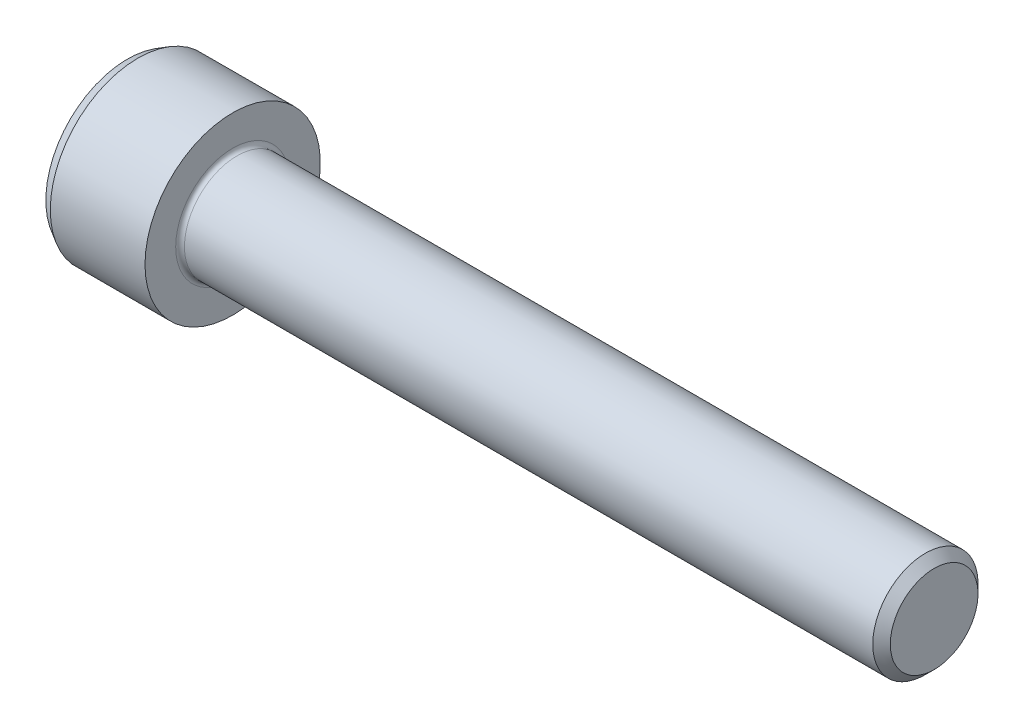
ISO-10303-21;
HEADER;
FILE_DESCRIPTION(('STEP AP214'),'2;1');
FILE_NAME('part.step','',(''),(''),'','','');
FILE_SCHEMA(('AUTOMOTIVE_DESIGN { 1 0 10303 214 1 1 1 1 }'));
ENDSEC;
DATA;
#1=APPLICATION_CONTEXT('core data for automotive mechanical design processes');
#2=APPLICATION_PROTOCOL_DEFINITION('international standard','automotive_design',2000,#1);
#3=PRODUCT_CONTEXT('',#1,'mechanical');
#4=PRODUCT('Part','Part','',(#3));
#5=PRODUCT_RELATED_PRODUCT_CATEGORY('part','',(#4));
#6=PRODUCT_DEFINITION_FORMATION('','',#4);
#7=PRODUCT_DEFINITION_CONTEXT('part definition',#1,'design');
#8=PRODUCT_DEFINITION('design','',#6,#7);
#9=PRODUCT_DEFINITION_SHAPE('','',#8);
#10=(LENGTH_UNIT() NAMED_UNIT(*) SI_UNIT(.MILLI.,.METRE.));
#11=(NAMED_UNIT(*) PLANE_ANGLE_UNIT() SI_UNIT($,.RADIAN.));
#12=(NAMED_UNIT(*) SI_UNIT($,.STERADIAN.) SOLID_ANGLE_UNIT());
#13=UNCERTAINTY_MEASURE_WITH_UNIT(LENGTH_MEASURE(1.E-05),#10,'distance_accuracy_value','');
#14=(GEOMETRIC_REPRESENTATION_CONTEXT(3) GLOBAL_UNCERTAINTY_ASSIGNED_CONTEXT((#13)) GLOBAL_UNIT_ASSIGNED_CONTEXT((#10,
#11,#12)) REPRESENTATION_CONTEXT('',''));
#15=CARTESIAN_POINT('',(0.,0.,0.));
#16=DIRECTION('',(0.,0.,1.));
#17=DIRECTION('',(1.,0.,0.));
#18=AXIS2_PLACEMENT_3D('',#15,#16,#17);
#19=CARTESIAN_POINT('',(-6.,5.,0.));
#20=DIRECTION('',(1.,0.,0.));
#21=DIRECTION('',(0.,0.,-1.));
#22=AXIS2_PLACEMENT_3D('',#19,#20,#21);
#23=PLANE('',#22);
#24=CARTESIAN_POINT('',(-6.,0.,0.));
#25=DIRECTION('',(1.,0.,0.));
#26=DIRECTION('',(0.,0.,-1.));
#27=AXIS2_PLACEMENT_3D('',#24,#25,#26);
#28=CIRCLE('',#27,4.65358983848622);
#29=CARTESIAN_POINT('',(-6.,0.,-4.65358983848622));
#30=VERTEX_POINT('',#29);
#31=EDGE_CURVE('E156',#30,#30,#28,.F.);
#32=ORIENTED_EDGE('',*,*,#31,.T.);
#33=EDGE_LOOP('',(#32));
#34=FACE_BOUND('',#33,.T.);
#35=CARTESIAN_POINT('',(-6.,0.,0.));
#36=DIRECTION('',(-1.,0.,0.));
#37=DIRECTION('',(0.,0.,1.));
#38=AXIS2_PLACEMENT_3D('',#35,#36,#37);
#39=CIRCLE('',#38,2.88675134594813);
#40=CARTESIAN_POINT('',(-6.,-1.44337567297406,-2.5));
#41=VERTEX_POINT('',#40);
#42=CARTESIAN_POINT('',(-6.,-2.88675134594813,0.));
#43=VERTEX_POINT('',#42);
#44=EDGE_CURVE('E286',#41,#43,#39,.T.);
#45=ORIENTED_EDGE('',*,*,#44,.F.);
#46=CARTESIAN_POINT('',(-6.,1.44337567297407,-2.5));
#47=VERTEX_POINT('',#46);
#48=EDGE_CURVE('E289',#47,#41,#39,.T.);
#49=ORIENTED_EDGE('',*,*,#48,.F.);
#50=CARTESIAN_POINT('',(-6.,2.88675134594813,0.));
#51=VERTEX_POINT('',#50);
#52=EDGE_CURVE('E296',#51,#47,#39,.T.);
#53=ORIENTED_EDGE('',*,*,#52,.F.);
#54=CARTESIAN_POINT('',(-6.,1.44337567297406,2.5));
#55=VERTEX_POINT('',#54);
#56=EDGE_CURVE('E60',#55,#51,#39,.T.);
#57=ORIENTED_EDGE('',*,*,#56,.F.);
#58=CARTESIAN_POINT('',(-6.,-1.44337567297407,2.5));
#59=VERTEX_POINT('',#58);
#60=EDGE_CURVE('E67',#59,#55,#39,.T.);
#61=ORIENTED_EDGE('',*,*,#60,.F.);
#62=EDGE_CURVE('E290',#43,#59,#39,.T.);
#63=ORIENTED_EDGE('',*,*,#62,.F.);
#64=EDGE_LOOP('',(#45,#49,#53,#57,#61,#63));
#65=FACE_BOUND('',#64,.T.);
#66=ADVANCED_FACE('F45',(#34,#65),#23,.F.);
#67=CARTESIAN_POINT('',(40.,0.,0.));
#68=DIRECTION('',(-1.,0.,0.));
#69=DIRECTION('',(0.,0.,1.));
#70=AXIS2_PLACEMENT_3D('',#67,#68,#69);
#71=PLANE('',#70);
#72=CARTESIAN_POINT('',(40.,0.,0.));
#73=DIRECTION('',(-1.,0.,0.));
#74=DIRECTION('',(0.,0.,1.));
#75=AXIS2_PLACEMENT_3D('',#72,#73,#74);
#76=CIRCLE('',#75,2.49999999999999);
#77=CARTESIAN_POINT('',(40.,0.,2.49999999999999));
#78=VERTEX_POINT('',#77);
#79=EDGE_CURVE('E11',#78,#78,#76,.F.);
#80=ORIENTED_EDGE('',*,*,#79,.T.);
#81=EDGE_LOOP('',(#80));
#82=FACE_BOUND('',#81,.T.);
#83=ADVANCED_FACE('F272',(#82),#71,.F.);
#84=CARTESIAN_POINT('',(-24.6844493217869,0.,0.));
#85=DIRECTION('',(-1.,0.,0.));
#86=DIRECTION('',(0.,0.,1.));
#87=AXIS2_PLACEMENT_3D('',#84,#85,#86);
#88=CYLINDRICAL_SURFACE('',#87,2.99999999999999);
#89=CARTESIAN_POINT('',(39.5,0.,0.));
#90=DIRECTION('',(-1.,0.,0.));
#91=DIRECTION('',(0.,0.,1.));
#92=AXIS2_PLACEMENT_3D('',#89,#90,#91);
#93=CIRCLE('',#92,2.99999999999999);
#94=CARTESIAN_POINT('',(39.5,0.,2.99999999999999));
#95=VERTEX_POINT('',#94);
#96=EDGE_CURVE('E54',#95,#95,#93,.T.);
#97=ORIENTED_EDGE('',*,*,#96,.T.);
#98=EDGE_LOOP('',(#97));
#99=FACE_BOUND('',#98,.T.);
#100=CARTESIAN_POINT('',(0.25,0.,0.));
#101=DIRECTION('',(-1.,0.,0.));
#102=DIRECTION('',(0.,0.,1.));
#103=AXIS2_PLACEMENT_3D('',#100,#101,#102);
#104=CIRCLE('',#103,2.99999999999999);
#105=CARTESIAN_POINT('',(0.25,0.,2.99999999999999));
#106=VERTEX_POINT('',#105);
#107=EDGE_CURVE('E453',#106,#106,#104,.F.);
#108=ORIENTED_EDGE('',*,*,#107,.T.);
#109=EDGE_LOOP('',(#108));
#110=FACE_BOUND('',#109,.T.);
#111=ADVANCED_FACE('F278',(#99,#110),#88,.T.);
#112=CARTESIAN_POINT('',(0.,2.99999999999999,0.));
#113=DIRECTION('',(-1.,0.,0.));
#114=DIRECTION('',(0.,0.,1.));
#115=AXIS2_PLACEMENT_3D('',#112,#113,#114);
#116=PLANE('',#115);
#117=CARTESIAN_POINT('',(0.,0.,0.));
#118=DIRECTION('',(-1.,0.,0.));
#119=DIRECTION('',(0.,0.,1.));
#120=AXIS2_PLACEMENT_3D('',#117,#118,#119);
#121=CIRCLE('',#120,3.24999999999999);
#122=CARTESIAN_POINT('',(0.,0.,3.24999999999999));
#123=VERTEX_POINT('',#122);
#124=EDGE_CURVE('E456',#123,#123,#121,.T.);
#125=ORIENTED_EDGE('',*,*,#124,.T.);
#126=EDGE_LOOP('',(#125));
#127=FACE_BOUND('',#126,.T.);
#128=CARTESIAN_POINT('',(0.,0.,0.));
#129=DIRECTION('',(-1.,0.,0.));
#130=DIRECTION('',(0.,0.,1.));
#131=AXIS2_PLACEMENT_3D('',#128,#129,#130);
#132=CIRCLE('',#131,5.);
#133=CARTESIAN_POINT('',(0.,0.,5.));
#134=VERTEX_POINT('',#133);
#135=EDGE_CURVE('E126',#134,#134,#132,.T.);
#136=ORIENTED_EDGE('',*,*,#135,.F.);
#137=EDGE_LOOP('',(#136));
#138=FACE_BOUND('',#137,.T.);
#139=ADVANCED_FACE('F324',(#127,#138),#116,.F.);
#140=CARTESIAN_POINT('',(-24.6844493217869,0.,0.));
#141=DIRECTION('',(-1.,0.,0.));
#142=DIRECTION('',(0.,0.,1.));
#143=AXIS2_PLACEMENT_3D('',#140,#141,#142);
#144=CYLINDRICAL_SURFACE('',#143,5.);
#145=CARTESIAN_POINT('',(-5.39999999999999,0.,0.));
#146=DIRECTION('',(1.,0.,0.));
#147=DIRECTION('',(0.,0.,-1.));
#148=AXIS2_PLACEMENT_3D('',#145,#146,#147);
#149=CIRCLE('',#148,5.);
#150=CARTESIAN_POINT('',(-5.39999999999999,0.,-5.));
#151=VERTEX_POINT('',#150);
#152=EDGE_CURVE('E461',#151,#151,#149,.T.);
#153=ORIENTED_EDGE('',*,*,#152,.T.);
#154=EDGE_LOOP('',(#153));
#155=FACE_BOUND('',#154,.T.);
#156=ORIENTED_EDGE('',*,*,#135,.T.);
#157=EDGE_LOOP('',(#156));
#158=FACE_BOUND('',#157,.T.);
#159=ADVANCED_FACE('F320',(#155,#158),#144,.T.);
#160=CARTESIAN_POINT('',(-4.33333333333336,0.,0.));
#161=DIRECTION('',(-1.,0.,0.));
#162=DIRECTION('',(0.,0.,1.));
#163=AXIS2_PLACEMENT_3D('',#160,#161,#162);
#164=CONICAL_SURFACE('',#163,0.,1.0471975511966);
#165=ORIENTED_EDGE('',*,*,#48,.T.);
#166=CARTESIAN_POINT('',(-6.92958822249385,-3.73786280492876,-2.5));
#167=CARTESIAN_POINT('',(-6.87779376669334,-3.62990419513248,-2.5));
#168=CARTESIAN_POINT('',(-6.82653728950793,-3.52168258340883,-2.5));
#169=CARTESIAN_POINT('',(-6.72540547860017,-3.30457318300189,-2.5));
#170=CARTESIAN_POINT('',(-6.67553039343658,-3.19568527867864,-2.5));
#171=CARTESIAN_POINT('',(-6.57718792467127,-2.97647878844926,-2.5));
#172=CARTESIAN_POINT('',(-6.52873091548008,-2.86615553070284,-2.5));
#173=CARTESIAN_POINT('',(-6.4339898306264,-2.64458325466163,-2.5));
#174=CARTESIAN_POINT('',(-6.38770564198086,-2.53333428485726,-2.5));
#175=CARTESIAN_POINT('',(-6.29671021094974,-2.30680312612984,-2.5));
#176=CARTESIAN_POINT('',(-6.25207173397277,-2.19149153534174,-2.5));
#177=CARTESIAN_POINT('',(-6.16650605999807,-1.95947357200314,-2.5));
#178=CARTESIAN_POINT('',(-6.12557929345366,-1.84276703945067,-2.5));
#179=CARTESIAN_POINT('',(-6.04860741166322,-1.60804308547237,-2.5));
#180=CARTESIAN_POINT('',(-6.01255100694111,-1.49002940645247,-2.5));
#181=CARTESIAN_POINT('',(-5.94655292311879,-1.25231072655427,-2.5));
#182=CARTESIAN_POINT('',(-5.91660972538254,-1.13260615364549,-2.5));
#183=CARTESIAN_POINT('',(-5.86443425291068,-0.891755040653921,-2.5));
#184=CARTESIAN_POINT('',(-5.84218614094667,-0.77061199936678,-2.5));
#185=CARTESIAN_POINT('',(-5.8068576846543,-0.526970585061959,-2.5));
#186=CARTESIAN_POINT('',(-5.79377672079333,-0.404472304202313,-2.5));
#187=CARTESIAN_POINT('',(-5.77799621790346,-0.160266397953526,-2.5));
#188=CARTESIAN_POINT('',(-5.77517417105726,-0.0385668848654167,-2.5));
#189=CARTESIAN_POINT('',(-5.77983578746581,0.204641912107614,-2.5));
#190=CARTESIAN_POINT('',(-5.78732008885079,0.326151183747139,-2.5));
#191=CARTESIAN_POINT('',(-5.80869862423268,0.536550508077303,-2.5));
#192=CARTESIAN_POINT('',(-5.82040880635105,0.62567319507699,-2.5));
#193=CARTESIAN_POINT('',(-5.84856820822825,0.803173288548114,-2.5));
#194=CARTESIAN_POINT('',(-5.86501824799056,0.891550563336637,-2.5));
#195=CARTESIAN_POINT('',(-5.92060813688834,1.15551872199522,-2.5));
#196=CARTESIAN_POINT('',(-5.96597206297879,1.3298084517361,-2.5));
#197=CARTESIAN_POINT('',(-6.04347411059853,1.59042392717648,-2.5));
#198=CARTESIAN_POINT('',(-6.07124568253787,1.67812347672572,-2.5));
#199=CARTESIAN_POINT('',(-6.12935704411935,1.85261472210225,-2.5));
#200=CARTESIAN_POINT('',(-6.15969523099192,1.93940694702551,-2.5));
#201=CARTESIAN_POINT('',(-6.22250022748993,2.11219306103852,-2.5));
#202=CARTESIAN_POINT('',(-6.25496665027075,2.19818709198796,-2.5));
#203=CARTESIAN_POINT('',(-6.32167644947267,2.36949800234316,-2.5));
#204=CARTESIAN_POINT('',(-6.35592012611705,2.45481476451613,-2.5));
#205=CARTESIAN_POINT('',(-6.44552292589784,2.6725884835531,-2.5));
#206=CARTESIAN_POINT('',(-6.50193976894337,2.80460968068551,-2.5));
#207=CARTESIAN_POINT('',(-6.61748759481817,3.06746265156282,-2.5));
#208=CARTESIAN_POINT('',(-6.67661878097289,3.19829433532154,-2.5));
#209=CARTESIAN_POINT('',(-6.79697889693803,3.45901422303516,-2.5));
#210=CARTESIAN_POINT('',(-6.85820819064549,3.58890225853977,-2.5));
#211=CARTESIAN_POINT('',(-6.98230197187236,3.84789608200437,-2.5));
#212=CARTESIAN_POINT('',(-7.04516649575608,3.97700185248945,-2.5));
#213=CARTESIAN_POINT('',(-7.23583626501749,4.36367805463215,-2.5));
#214=CARTESIAN_POINT('',(-7.36557171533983,4.62029579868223,-2.5));
#215=CARTESIAN_POINT('',(-7.6283605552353,5.13177424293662,-2.5));
#216=CARTESIAN_POINT('',(-7.76141352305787,5.38663516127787,-2.5));
#217=CARTESIAN_POINT('',(-8.01715502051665,5.8711418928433,-2.5));
#218=CARTESIAN_POINT('',(-8.13963648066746,6.10089718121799,-2.5));
#219=CARTESIAN_POINT('',(-8.38599386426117,6.5596687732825,-2.5));
#220=CARTESIAN_POINT('',(-8.50986983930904,6.78868504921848,-2.5));
#221=CARTESIAN_POINT('',(-8.75835121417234,7.24556639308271,-2.5));
#222=CARTESIAN_POINT('',(-8.88295395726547,7.47343290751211,-2.5));
#223=CARTESIAN_POINT('',(-9.13297042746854,7.92870524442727,-2.5));
#224=CARTESIAN_POINT('',(-9.25838411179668,8.15611109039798,-2.5));
#225=CARTESIAN_POINT('',(-9.38409503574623,8.38335143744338,-2.5));
#226=B_SPLINE_CURVE_WITH_KNOTS('',3,(#166,#167,#168,#169,#170,#171,#172,#173,#174,#175,#176,
#177,#178,#179,#180,#181,#182,#183,#184,#185,#186,#187,#188,#189,#190,#191,#192,#193,#194,#195,
#196,#197,#198,#199,#200,#201,#202,#203,#204,#205,#206,#207,#208,#209,#210,#211,#212,#213,#214,
#215,#216,#217,#218,#219,#220,#221,#222,#223,#224,#225),.UNSPECIFIED.,.F.,.F.,(4,2,2,2,2,2,2,2,
2,2,2,2,2,2,2,2,2,2,2,2,2,2,2,2,2,2,2,2,2,4),(0.,0.359225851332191,0.718515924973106,
1.07998546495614,1.44143618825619,1.81233728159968,2.18328133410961,2.55335021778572,
2.92332705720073,3.29253785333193,3.66172369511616,4.02648611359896,4.39127111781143,
4.66080405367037,4.93038364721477,5.4699561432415,5.74591174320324,6.02169627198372,
6.29743081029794,6.57321207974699,7.00387919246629,7.43457861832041,7.86535312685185,
8.29613722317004,9.1587374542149,10.0212285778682,10.8023128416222,11.5834261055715,
12.3625525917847,13.1416383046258),.UNSPECIFIED.);
#227=EDGE_CURVE('E132',#47,#41,#226,.F.);
#228=ORIENTED_EDGE('',*,*,#227,.F.);
#229=EDGE_LOOP('',(#165,#228));
#230=FACE_BOUND('',#229,.T.);
#231=ADVANCED_FACE('F158',(#230),#164,.F.);
#232=ORIENTED_EDGE('',*,*,#44,.T.);
#233=CARTESIAN_POINT('',(-6.00006667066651,-1.44326020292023,-2.5002));
#234=CARTESIAN_POINT('',(-5.96343062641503,-1.50668977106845,-2.39033676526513));
#235=CARTESIAN_POINT('',(-5.93011122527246,-1.57066685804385,-2.27952520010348));
#236=CARTESIAN_POINT('',(-5.87195129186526,-1.69972891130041,-2.05598316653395));
#237=CARTESIAN_POINT('',(-5.84713133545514,-1.7648161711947,-1.94324872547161));
#238=CARTESIAN_POINT('',(-5.80849465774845,-1.8941840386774,-1.71917700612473));
#239=CARTESIAN_POINT('',(-5.79442080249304,-1.95844473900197,-1.60787420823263));
#240=CARTESIAN_POINT('',(-5.77761815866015,-2.08726857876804,-1.38474477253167));
#241=CARTESIAN_POINT('',(-5.77487545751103,-2.15183124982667,-1.27291894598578));
#242=CARTESIAN_POINT('',(-5.78057476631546,-2.27247489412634,-1.06395802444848));
#243=CARTESIAN_POINT('',(-5.78761740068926,-2.32857390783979,-0.966791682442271));
#244=CARTESIAN_POINT('',(-5.80994042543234,-2.44040644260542,-0.773092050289));
#245=CARTESIAN_POINT('',(-5.82522844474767,-2.4961395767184,-0.67655943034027));
#246=CARTESIAN_POINT('',(-5.86344810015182,-2.60820277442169,-0.482460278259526));
#247=CARTESIAN_POINT('',(-5.88654178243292,-2.66451865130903,-0.384918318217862));
#248=CARTESIAN_POINT('',(-5.93895566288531,-2.77631036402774,-0.191289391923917));
#249=CARTESIAN_POINT('',(-5.96826354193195,-2.83178763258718,-0.0951999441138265));
#250=CARTESIAN_POINT('',(-6.00006667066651,-2.88686681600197,0.00019999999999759));
#251=B_SPLINE_CURVE_WITH_KNOTS('',3,(#233,#234,#235,#236,#237,#238,#239,#240,#241,#242,#243,
#244,#245,#246,#247,#248,#249,#250),.UNSPECIFIED.,.F.,.F.,(4,2,2,2,2,2,2,2,4),(0.,
0.396285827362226,0.79352433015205,1.18093086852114,1.56786160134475,1.90479741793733,
2.24204551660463,2.58677531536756,2.93082800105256),.UNSPECIFIED.);
#252=EDGE_CURVE('E234',#41,#43,#251,.T.);
#253=ORIENTED_EDGE('',*,*,#252,.F.);
#254=EDGE_LOOP('',(#232,#253));
#255=FACE_BOUND('',#254,.T.);
#256=ADVANCED_FACE('F317',(#255),#164,.F.);
#257=ORIENTED_EDGE('',*,*,#62,.T.);
#258=CARTESIAN_POINT('',(-6.00006667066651,-2.88686681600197,-0.000200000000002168));
#259=CARTESIAN_POINT('',(-5.96343062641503,-2.82343724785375,0.109663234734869));
#260=CARTESIAN_POINT('',(-5.93011122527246,-2.75946016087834,0.220474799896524));
#261=CARTESIAN_POINT('',(-5.87195129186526,-2.63039810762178,0.444016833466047));
#262=CARTESIAN_POINT('',(-5.84713133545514,-2.5653108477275,0.556751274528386));
#263=CARTESIAN_POINT('',(-5.80849465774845,-2.43594298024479,0.780822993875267));
#264=CARTESIAN_POINT('',(-5.79442080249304,-2.37168227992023,0.892125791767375));
#265=CARTESIAN_POINT('',(-5.77761815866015,-2.24285844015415,1.11525522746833));
#266=CARTESIAN_POINT('',(-5.77487545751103,-2.17829576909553,1.22708105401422));
#267=CARTESIAN_POINT('',(-5.78057476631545,-2.05765212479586,1.43604197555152));
#268=CARTESIAN_POINT('',(-5.78761740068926,-2.0015531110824,1.53320831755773));
#269=CARTESIAN_POINT('',(-5.80994042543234,-1.88972057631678,1.726907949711));
#270=CARTESIAN_POINT('',(-5.82522844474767,-1.8339874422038,1.82344056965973));
#271=CARTESIAN_POINT('',(-5.86344810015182,-1.7219242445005,2.01753972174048));
#272=CARTESIAN_POINT('',(-5.88654178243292,-1.66560836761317,2.11508168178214));
#273=CARTESIAN_POINT('',(-5.93895566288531,-1.55381665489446,2.30871060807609));
#274=CARTESIAN_POINT('',(-5.96826354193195,-1.49833938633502,2.40480005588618));
#275=CARTESIAN_POINT('',(-6.00006667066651,-1.44326020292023,2.5002));
#276=B_SPLINE_CURVE_WITH_KNOTS('',3,(#258,#259,#260,#261,#262,#263,#264,#265,#266,#267,#268,
#269,#270,#271,#272,#273,#274,#275),.UNSPECIFIED.,.F.,.F.,(4,2,2,2,2,2,2,2,4),(0.,
0.396285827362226,0.79352433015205,1.18093086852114,1.56786160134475,1.90479741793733,
2.24204551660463,2.58677531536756,2.93082800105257),.UNSPECIFIED.);
#277=EDGE_CURVE('E224',#43,#59,#276,.T.);
#278=ORIENTED_EDGE('',*,*,#277,.F.);
#279=EDGE_LOOP('',(#257,#278));
#280=FACE_BOUND('',#279,.T.);
#281=ADVANCED_FACE('F316',(#280),#164,.F.);
#282=ORIENTED_EDGE('',*,*,#60,.T.);
#283=CARTESIAN_POINT('',(-6.92958822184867,-3.73786280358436,2.5));
#284=CARTESIAN_POINT('',(-6.87779376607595,-3.62990419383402,2.5));
#285=CARTESIAN_POINT('',(-6.82653728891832,-3.52168258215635,2.5));
#286=CARTESIAN_POINT('',(-6.72540547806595,-3.30457318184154,2.5));
#287=CARTESIAN_POINT('',(-6.67553039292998,-3.19568527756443,2.5));
#288=CARTESIAN_POINT('',(-6.57718792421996,-2.97647878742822,2.5));
#289=CARTESIAN_POINT('',(-6.52873091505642,-2.86615552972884,2.5));
#290=CARTESIAN_POINT('',(-6.43398983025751,-2.64458325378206,2.5));
#291=CARTESIAN_POINT('',(-6.38770564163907,-2.53333428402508,2.5));
#292=CARTESIAN_POINT('',(-6.29671021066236,-2.30680312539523,2.5));
#293=CARTESIAN_POINT('',(-6.25207173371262,-2.1914915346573,2.5));
#294=CARTESIAN_POINT('',(-6.16650605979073,-1.95947357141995,2.5));
#295=CARTESIAN_POINT('',(-6.1255792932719,-1.84276703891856,2.5));
#296=CARTESIAN_POINT('',(-6.04860741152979,-1.60804308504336,2.5));
#297=CARTESIAN_POINT('',(-6.01255100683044,-1.4900294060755,2.5));
#298=CARTESIAN_POINT('',(-5.94655292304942,-1.25231072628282,2.5));
#299=CARTESIAN_POINT('',(-5.91660972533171,-1.13260615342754,2.5));
#300=CARTESIAN_POINT('',(-5.86443425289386,-0.891755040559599,2.5));
#301=CARTESIAN_POINT('',(-5.8421861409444,-0.770611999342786,2.5));
#302=CARTESIAN_POINT('',(-5.80685768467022,-0.526970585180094,2.5));
#303=CARTESIAN_POINT('',(-5.79377672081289,-0.404472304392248,2.5));
#304=CARTESIAN_POINT('',(-5.77799621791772,-0.160266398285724,2.5));
#305=CARTESIAN_POINT('',(-5.77517417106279,-0.0385668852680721,2.5));
#306=CARTESIAN_POINT('',(-5.77983578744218,0.204641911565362,2.5));
#307=CARTESIAN_POINT('',(-5.78732008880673,0.326151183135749,2.5));
#308=CARTESIAN_POINT('',(-5.808698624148,0.536550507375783,2.5));
#309=CARTESIAN_POINT('',(-5.82040880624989,0.625673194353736,2.5));
#310=CARTESIAN_POINT('',(-5.84856820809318,0.803173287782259,2.5));
#311=CARTESIAN_POINT('',(-5.86501824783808,0.891550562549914,2.5));
#312=CARTESIAN_POINT('',(-5.92060813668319,1.15551872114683,2.5));
#313=CARTESIAN_POINT('',(-5.96597206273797,1.32980845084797,2.5));
#314=CARTESIAN_POINT('',(-6.04347411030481,1.59042392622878,2.5));
#315=CARTESIAN_POINT('',(-6.07124568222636,1.67812347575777,2.5));
#316=CARTESIAN_POINT('',(-6.12935704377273,1.85261472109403,2.5));
#317=CARTESIAN_POINT('',(-6.15969523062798,1.93940694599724,2.5));
#318=CARTESIAN_POINT('',(-6.22250022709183,2.11219305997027,2.5));
#319=CARTESIAN_POINT('',(-6.25496664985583,2.19818709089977,2.5));
#320=CARTESIAN_POINT('',(-6.32167644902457,2.36949800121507,2.5));
#321=CARTESIAN_POINT('',(-6.3559201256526,2.45481476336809,2.5));
#322=CARTESIAN_POINT('',(-6.44552292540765,2.67258848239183,2.5));
#323=CARTESIAN_POINT('',(-6.50193976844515,2.8046096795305,2.5));
#324=CARTESIAN_POINT('',(-6.61748759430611,3.06746265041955,2.5));
#325=CARTESIAN_POINT('',(-6.67661878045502,3.19829433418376,2.5));
#326=CARTESIAN_POINT('',(-6.79697889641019,3.45901422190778,2.5));
#327=CARTESIAN_POINT('',(-6.85820819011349,3.5889022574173,2.5));
#328=CARTESIAN_POINT('',(-6.98230197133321,3.84789608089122,2.5));
#329=CARTESIAN_POINT('',(-7.04516649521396,3.97700185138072,2.5));
#330=CARTESIAN_POINT('',(-7.23583626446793,4.36367805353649,2.5));
#331=CARTESIAN_POINT('',(-7.36557171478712,4.62029579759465,2.5));
#332=CARTESIAN_POINT('',(-7.62836055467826,5.13177424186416,2.5));
#333=CARTESIAN_POINT('',(-7.76141352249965,5.38663516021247,2.5));
#334=CARTESIAN_POINT('',(-8.01715501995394,5.87114189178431,2.5));
#335=CARTESIAN_POINT('',(-8.13963648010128,6.10089718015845,2.5));
#336=CARTESIAN_POINT('',(-8.38599386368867,6.55966877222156,2.5));
#337=CARTESIAN_POINT('',(-8.5098698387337,6.7886850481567,2.5));
#338=CARTESIAN_POINT('',(-8.75835121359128,7.24556639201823,2.5));
#339=CARTESIAN_POINT('',(-8.88295395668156,7.47343290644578,2.5));
#340=CARTESIAN_POINT('',(-9.1329704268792,7.92870524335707,2.5));
#341=CARTESIAN_POINT('',(-9.25838411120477,8.15611108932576,2.5));
#342=CARTESIAN_POINT('',(-9.38409503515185,8.38335143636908,2.5));
#343=B_SPLINE_CURVE_WITH_KNOTS('',3,(#283,#284,#285,#286,#287,#288,#289,#290,#291,#292,#293,
#294,#295,#296,#297,#298,#299,#300,#301,#302,#303,#304,#305,#306,#307,#308,#309,#310,#311,#312,
#313,#314,#315,#316,#317,#318,#319,#320,#321,#322,#323,#324,#325,#326,#327,#328,#329,#330,#331,
#332,#333,#334,#335,#336,#337,#338,#339,#340,#341,#342),.UNSPECIFIED.,.F.,.F.,(4,2,2,2,2,2,2,2,
2,2,2,2,2,2,2,2,2,2,2,2,2,2,2,2,2,2,2,2,2,4),(0.,0.359225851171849,0.718515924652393,
1.07998546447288,1.44143618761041,1.81233728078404,2.18328133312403,2.55335021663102,
2.92332705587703,3.29253785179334,3.66172369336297,4.02648611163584,4.3912711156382,
4.66080405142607,4.93038364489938,5.46995614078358,5.74591174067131,6.02169626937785,
6.29743080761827,6.57321207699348,7.00387918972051,7.43457861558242,7.86535312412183,
8.296137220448,9.15873745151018,10.0212285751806,10.8023128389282,11.5834261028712,
12.3625525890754,13.1416383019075),.UNSPECIFIED.);
#344=EDGE_CURVE('E233',#59,#55,#343,.T.);
#345=ORIENTED_EDGE('',*,*,#344,.F.);
#346=EDGE_LOOP('',(#282,#345));
#347=FACE_BOUND('',#346,.T.);
#348=ADVANCED_FACE('F331',(#347),#164,.F.);
#349=ORIENTED_EDGE('',*,*,#56,.T.);
#350=CARTESIAN_POINT('',(-6.00006667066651,1.44326020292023,2.5002));
#351=CARTESIAN_POINT('',(-5.96343062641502,1.50668977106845,2.39033676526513));
#352=CARTESIAN_POINT('',(-5.93011122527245,1.57066685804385,2.27952520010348));
#353=CARTESIAN_POINT('',(-5.87195129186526,1.69972891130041,2.05598316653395));
#354=CARTESIAN_POINT('',(-5.84713133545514,1.7648161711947,1.94324872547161));
#355=CARTESIAN_POINT('',(-5.80849465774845,1.8941840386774,1.71917700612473));
#356=CARTESIAN_POINT('',(-5.79442080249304,1.95844473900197,1.60787420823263));
#357=CARTESIAN_POINT('',(-5.77761815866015,2.08726857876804,1.38474477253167));
#358=CARTESIAN_POINT('',(-5.77487545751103,2.15183124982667,1.27291894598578));
#359=CARTESIAN_POINT('',(-5.78057476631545,2.27247489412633,1.06395802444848));
#360=CARTESIAN_POINT('',(-5.78761740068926,2.32857390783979,0.966791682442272));
#361=CARTESIAN_POINT('',(-5.80994042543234,2.44040644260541,0.773092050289));
#362=CARTESIAN_POINT('',(-5.82522844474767,2.49613957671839,0.67655943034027));
#363=CARTESIAN_POINT('',(-5.86344810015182,2.60820277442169,0.482460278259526));
#364=CARTESIAN_POINT('',(-5.88654178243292,2.66451865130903,0.384918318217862));
#365=CARTESIAN_POINT('',(-5.93895566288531,2.77631036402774,0.191289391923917));
#366=CARTESIAN_POINT('',(-5.96826354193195,2.83178763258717,0.0951999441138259));
#367=CARTESIAN_POINT('',(-6.00006667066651,2.88686681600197,-0.000199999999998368));
#368=B_SPLINE_CURVE_WITH_KNOTS('',3,(#350,#351,#352,#353,#354,#355,#356,#357,#358,#359,#360,
#361,#362,#363,#364,#365,#366,#367),.UNSPECIFIED.,.F.,.F.,(4,2,2,2,2,2,2,2,4),(0.,
0.396285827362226,0.793524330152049,1.18093086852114,1.56786160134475,1.90479741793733,
2.24204551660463,2.58677531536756,2.93082800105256),.UNSPECIFIED.);
#369=EDGE_CURVE('E247',#55,#51,#368,.T.);
#370=ORIENTED_EDGE('',*,*,#369,.F.);
#371=EDGE_LOOP('',(#349,#370));
#372=FACE_BOUND('',#371,.T.);
#373=ADVANCED_FACE('F327',(#372),#164,.F.);
#374=ORIENTED_EDGE('',*,*,#52,.T.);
#375=CARTESIAN_POINT('',(-6.00006667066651,2.88686681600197,0.000200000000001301));
#376=CARTESIAN_POINT('',(-5.96343062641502,2.82343724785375,-0.10966323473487));
#377=CARTESIAN_POINT('',(-5.93011122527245,2.75946016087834,-0.220474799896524));
#378=CARTESIAN_POINT('',(-5.87195129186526,2.63039810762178,-0.444016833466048));
#379=CARTESIAN_POINT('',(-5.84713133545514,2.5653108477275,-0.556751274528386));
#380=CARTESIAN_POINT('',(-5.80849465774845,2.43594298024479,-0.780822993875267));
#381=CARTESIAN_POINT('',(-5.79442080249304,2.37168227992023,-0.892125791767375));
#382=CARTESIAN_POINT('',(-5.77761815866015,2.24285844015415,-1.11525522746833));
#383=CARTESIAN_POINT('',(-5.77487545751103,2.17829576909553,-1.22708105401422));
#384=CARTESIAN_POINT('',(-5.78057476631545,2.05765212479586,-1.43604197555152));
#385=CARTESIAN_POINT('',(-5.78761740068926,2.0015531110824,-1.53320831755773));
#386=CARTESIAN_POINT('',(-5.80994042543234,1.88972057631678,-1.726907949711));
#387=CARTESIAN_POINT('',(-5.82522844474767,1.8339874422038,-1.82344056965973));
#388=CARTESIAN_POINT('',(-5.86344810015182,1.7219242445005,-2.01753972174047));
#389=CARTESIAN_POINT('',(-5.88654178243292,1.66560836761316,-2.11508168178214));
#390=CARTESIAN_POINT('',(-5.93895566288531,1.55381665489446,-2.30871060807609));
#391=CARTESIAN_POINT('',(-5.96826354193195,1.49833938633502,-2.40480005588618));
#392=CARTESIAN_POINT('',(-6.00006667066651,1.44326020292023,-2.5002));
#393=B_SPLINE_CURVE_WITH_KNOTS('',3,(#375,#376,#377,#378,#379,#380,#381,#382,#383,#384,#385,
#386,#387,#388,#389,#390,#391,#392),.UNSPECIFIED.,.F.,.F.,(4,2,2,2,2,2,2,2,4),(0.,
0.396285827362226,0.793524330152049,1.18093086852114,1.56786160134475,1.90479741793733,
2.24204551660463,2.58677531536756,2.93082800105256),.UNSPECIFIED.);
#394=EDGE_CURVE('E144',#51,#47,#393,.T.);
#395=ORIENTED_EDGE('',*,*,#394,.F.);
#396=EDGE_LOOP('',(#374,#395));
#397=FACE_BOUND('',#396,.T.);
#398=ADVANCED_FACE('F183',(#397),#164,.F.);
#399=CARTESIAN_POINT('',(-1.55662432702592,0.,0.));
#400=DIRECTION('',(-1.,0.,0.));
#401=DIRECTION('',(0.,-1.,0.));
#402=AXIS2_PLACEMENT_3D('',#399,#400,#401);
#403=CONICAL_SURFACE('',#402,0.,1.04719755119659);
#404=CARTESIAN_POINT('',(-3.22335766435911,-2.88686681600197,0.000199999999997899));
#405=CARTESIAN_POINT('',(-3.18672162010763,-2.82343724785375,-0.109663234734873));
#406=CARTESIAN_POINT('',(-3.15340221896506,-2.75946016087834,-0.220474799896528));
#407=CARTESIAN_POINT('',(-3.09524228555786,-2.63039810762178,-0.444016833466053));
#408=CARTESIAN_POINT('',(-3.07042232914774,-2.5653108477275,-0.556751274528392));
#409=CARTESIAN_POINT('',(-3.03178565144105,-2.43594298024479,-0.780822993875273));
#410=CARTESIAN_POINT('',(-3.01771179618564,-2.37168227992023,-0.892125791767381));
#411=CARTESIAN_POINT('',(-3.00090915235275,-2.24285844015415,-1.11525522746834));
#412=CARTESIAN_POINT('',(-2.99816645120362,-2.17829576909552,-1.22708105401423));
#413=CARTESIAN_POINT('',(-3.00386576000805,-2.05765212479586,-1.43604197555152));
#414=CARTESIAN_POINT('',(-3.01090839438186,-2.0015531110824,-1.53320831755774));
#415=CARTESIAN_POINT('',(-3.03323141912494,-1.88972057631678,-1.72690794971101));
#416=CARTESIAN_POINT('',(-3.04851943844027,-1.8339874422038,-1.82344056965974));
#417=CARTESIAN_POINT('',(-3.08673909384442,-1.7219242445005,-2.01753972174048));
#418=CARTESIAN_POINT('',(-3.10983277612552,-1.66560836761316,-2.11508168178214));
#419=CARTESIAN_POINT('',(-3.16224665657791,-1.55381665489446,-2.30871060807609));
#420=CARTESIAN_POINT('',(-3.19155453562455,-1.49833938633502,-2.40480005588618));
#421=CARTESIAN_POINT('',(-3.22335766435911,-1.44326020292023,-2.5002));
#422=B_SPLINE_CURVE_WITH_KNOTS('',3,(#404,#405,#406,#407,#408,#409,#410,#411,#412,#413,#414,
#415,#416,#417,#418,#419,#420,#421),.UNSPECIFIED.,.F.,.F.,(4,2,2,2,2,2,2,2,4),(0.,
0.396285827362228,0.793524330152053,1.18093086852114,1.56786160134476,1.90479741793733,
2.24204551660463,2.58677531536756,2.93082800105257),.UNSPECIFIED.);
#423=CARTESIAN_POINT('',(-3.2232909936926,-2.88675134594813,0.));
#424=VERTEX_POINT('',#423);
#425=CARTESIAN_POINT('',(-3.2232909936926,-1.44337567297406,-2.5));
#426=VERTEX_POINT('',#425);
#427=EDGE_CURVE('E108',#424,#426,#422,.T.);
#428=ORIENTED_EDGE('',*,*,#427,.F.);
#429=CARTESIAN_POINT('',(-3.22335766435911,-1.44326020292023,2.5002));
#430=CARTESIAN_POINT('',(-3.18672162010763,-1.50668977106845,2.39033676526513));
#431=CARTESIAN_POINT('',(-3.15340221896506,-1.57066685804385,2.27952520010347));
#432=CARTESIAN_POINT('',(-3.09524228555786,-1.69972891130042,2.05598316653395));
#433=CARTESIAN_POINT('',(-3.07042232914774,-1.7648161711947,1.94324872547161));
#434=CARTESIAN_POINT('',(-3.03178565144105,-1.8941840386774,1.71917700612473));
#435=CARTESIAN_POINT('',(-3.01771179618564,-1.95844473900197,1.60787420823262));
#436=CARTESIAN_POINT('',(-3.00090915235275,-2.08726857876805,1.38474477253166));
#437=CARTESIAN_POINT('',(-2.99816645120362,-2.15183124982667,1.27291894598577));
#438=CARTESIAN_POINT('',(-3.00386576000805,-2.27247489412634,1.06395802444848));
#439=CARTESIAN_POINT('',(-3.01090839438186,-2.3285739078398,0.966791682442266));
#440=CARTESIAN_POINT('',(-3.03323141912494,-2.44040644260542,0.773092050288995));
#441=CARTESIAN_POINT('',(-3.04851943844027,-2.4961395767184,0.676559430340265));
#442=CARTESIAN_POINT('',(-3.08673909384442,-2.60820277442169,0.482460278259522));
#443=CARTESIAN_POINT('',(-3.10983277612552,-2.66451865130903,0.384918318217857));
#444=CARTESIAN_POINT('',(-3.16224665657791,-2.77631036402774,0.191289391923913));
#445=CARTESIAN_POINT('',(-3.19155453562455,-2.83178763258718,0.0951999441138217));
#446=CARTESIAN_POINT('',(-3.22335766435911,-2.88686681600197,-0.000200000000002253));
#447=B_SPLINE_CURVE_WITH_KNOTS('',3,(#429,#430,#431,#432,#433,#434,#435,#436,#437,#438,#439,
#440,#441,#442,#443,#444,#445,#446),.UNSPECIFIED.,.F.,.F.,(4,2,2,2,2,2,2,2,4),(0.,
0.396285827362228,0.793524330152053,1.18093086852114,1.56786160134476,1.90479741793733,
2.24204551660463,2.58677531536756,2.93082800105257),.UNSPECIFIED.);
#448=CARTESIAN_POINT('',(-3.2232909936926,-1.44337567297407,2.5));
#449=VERTEX_POINT('',#448);
#450=EDGE_CURVE('E127',#449,#424,#447,.T.);
#451=ORIENTED_EDGE('',*,*,#450,.F.);
#452=CARTESIAN_POINT('',(-4.21129388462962,-3.85899097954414,2.5));
#453=CARTESIAN_POINT('',(-4.15842477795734,-3.74985192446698,2.5));
#454=CARTESIAN_POINT('',(-4.10606828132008,-3.64046016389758,2.5));
#455=CARTESIAN_POINT('',(-4.00266954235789,-3.42103657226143,2.5));
#456=CARTESIAN_POINT('',(-3.95162751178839,-3.31100464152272,2.5));
#457=CARTESIAN_POINT('',(-3.85088661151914,-3.08959157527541,2.5));
#458=CARTESIAN_POINT('',(-3.80119671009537,-2.97820634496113,2.5));
#459=CARTESIAN_POINT('',(-3.70387799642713,-2.75454240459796,2.5));
#460=CARTESIAN_POINT('',(-3.65624908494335,-2.64226373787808,2.5));
#461=CARTESIAN_POINT('',(-3.56222264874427,-2.41328522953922,2.5));
#462=CARTESIAN_POINT('',(-3.51590352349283,-2.29655301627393,2.5));
#463=CARTESIAN_POINT('',(-3.42681491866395,-2.06171688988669,2.5));
#464=CARTESIAN_POINT('',(-3.38404583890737,-1.94361282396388,2.5));
#465=CARTESIAN_POINT('',(-3.30319182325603,-1.7060710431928,2.5));
#466=CARTESIAN_POINT('',(-3.26509730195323,-1.58663662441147,2.5));
#467=CARTESIAN_POINT('',(-3.1948256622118,-1.34605613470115,2.5));
#468=CARTESIAN_POINT('',(-3.16264666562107,-1.2249106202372,2.5));
#469=CARTESIAN_POINT('',(-3.10590664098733,-0.981408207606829,2.5));
#470=CARTESIAN_POINT('',(-3.08131097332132,-0.859059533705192,2.5));
#471=CARTESIAN_POINT('',(-3.04117645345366,-0.612862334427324,2.5));
#472=CARTESIAN_POINT('',(-3.02563659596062,-0.48901397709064,2.5));
#473=CARTESIAN_POINT('',(-3.00505547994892,-0.242034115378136,2.5));
#474=CARTESIAN_POINT('',(-2.9998814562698,-0.118913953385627,2.5));
#475=CARTESIAN_POINT('',(-3.00012263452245,0.127331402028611,2.5));
#476=CARTESIAN_POINT('',(-3.00553859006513,0.250456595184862,2.5));
#477=CARTESIAN_POINT('',(-3.02337771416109,0.459885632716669,2.5));
#478=CARTESIAN_POINT('',(-3.03328524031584,0.546416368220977,2.5));
#479=CARTESIAN_POINT('',(-3.05770573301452,0.718829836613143,2.5));
#480=CARTESIAN_POINT('',(-3.07221932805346,0.804712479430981,2.5));
#481=CARTESIAN_POINT('',(-3.12190366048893,1.06126616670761,2.5));
#482=CARTESIAN_POINT('',(-3.16321008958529,1.23076139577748,2.5));
#483=CARTESIAN_POINT('',(-3.23471704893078,1.48445907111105,2.5));
#484=CARTESIAN_POINT('',(-3.26052039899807,1.56997501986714,2.5));
#485=CARTESIAN_POINT('',(-3.31476470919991,1.74017440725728,2.5));
#486=CARTESIAN_POINT('',(-3.34320569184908,1.8248578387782,2.5));
#487=CARTESIAN_POINT('',(-3.40227346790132,1.99342650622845,2.5));
#488=CARTESIAN_POINT('',(-3.43289967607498,2.07731194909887,2.5));
#489=CARTESIAN_POINT('',(-3.49597824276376,2.24438679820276,2.5));
#490=CARTESIAN_POINT('',(-3.52843051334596,2.32757623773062,2.5));
#491=CARTESIAN_POINT('',(-3.60509971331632,2.51890033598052,2.5));
#492=CARTESIAN_POINT('',(-3.64985875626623,2.62681733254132,2.5));
#493=CARTESIAN_POINT('',(-3.74145173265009,2.84176924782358,2.5));
#494=CARTESIAN_POINT('',(-3.78828577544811,2.94880411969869,2.5));
#495=CARTESIAN_POINT('',(-3.93127989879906,3.26884411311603,2.5));
#496=CARTESIAN_POINT('',(-4.02991462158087,3.48074231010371,2.5));
#497=CARTESIAN_POINT('',(-4.23159120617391,3.90259403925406,2.5));
#498=CARTESIAN_POINT('',(-4.33463615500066,4.11254607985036,2.5));
#499=CARTESIAN_POINT('',(-4.5437383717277,4.53095026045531,2.5));
#500=CARTESIAN_POINT('',(-4.64979574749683,4.73940234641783,2.5));
#501=CARTESIAN_POINT('',(-4.86431829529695,5.15570923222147,2.5));
#502=CARTESIAN_POINT('',(-4.97278874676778,5.36356130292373,2.5));
#503=CARTESIAN_POINT('',(-5.19132280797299,5.77843146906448,2.5));
#504=CARTESIAN_POINT('',(-5.30138645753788,5.98544954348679,2.5));
#505=CARTESIAN_POINT('',(-5.63325193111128,6.60536551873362,2.5));
#506=CARTESIAN_POINT('',(-5.85682639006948,7.01731359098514,2.5));
#507=CARTESIAN_POINT('',(-6.27073432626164,7.77369724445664,2.5));
#508=CARTESIAN_POINT('',(-6.46064780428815,8.11836367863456,2.5));
#509=CARTESIAN_POINT('',(-6.84191707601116,8.80695745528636,2.5));
#510=CARTESIAN_POINT('',(-7.03327305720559,9.15088469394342,2.5));
#511=CARTESIAN_POINT('',(-7.41616361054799,9.8366763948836,2.5));
#512=CARTESIAN_POINT('',(-7.60769377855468,10.1785433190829,2.5));
#513=CARTESIAN_POINT('',(-7.99149345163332,10.8617985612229,2.5));
#514=CARTESIAN_POINT('',(-8.18376284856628,11.2031869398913,2.5));
#515=CARTESIAN_POINT('',(-8.37629608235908,11.5444258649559,2.5));
#516=B_SPLINE_CURVE_WITH_KNOTS('',3,(#452,#453,#454,#455,#456,#457,#458,#459,#460,#461,#462,
#463,#464,#465,#466,#467,#468,#469,#470,#471,#472,#473,#474,#475,#476,#477,#478,#479,#480,#481,
#482,#483,#484,#485,#486,#487,#488,#489,#490,#491,#492,#493,#494,#495,#496,#497,#498,#499,#500,
#501,#502,#503,#504,#505,#506,#507,#508,#509,#510,#511,#512,#513,#514,#515),.UNSPECIFIED.,.F.,
.F.,(4,2,2,2,2,2,2,2,2,2,2,2,2,2,2,2,2,2,2,2,2,2,2,2,2,2,2,2,2,2,2,4),(0.,0.363815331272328,
0.727688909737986,1.09357083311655,1.45943511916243,1.83614883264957,2.21290491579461,
2.58887505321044,2.96472561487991,3.33883299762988,3.71289884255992,4.08214223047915,
4.45141189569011,4.71257353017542,4.97377081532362,5.49641013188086,5.76436001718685,
6.03231218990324,6.30019286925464,6.56806065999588,6.91852438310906,7.26900659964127,
7.97010813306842,8.67170870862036,9.37333443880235,10.076685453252,10.780054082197,
12.1861540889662,13.3667268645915,14.547455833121,15.7230445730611,16.8984674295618),.UNSPECIFIED.);
#517=CARTESIAN_POINT('',(-3.2232909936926,1.44337567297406,2.5));
#518=VERTEX_POINT('',#517);
#519=EDGE_CURVE('E199',#518,#449,#516,.F.);
#520=ORIENTED_EDGE('',*,*,#519,.F.);
#521=CARTESIAN_POINT('',(-3.22335766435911,2.88686681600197,-0.000199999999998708));
#522=CARTESIAN_POINT('',(-3.18672162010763,2.82343724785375,0.109663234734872));
#523=CARTESIAN_POINT('',(-3.15340221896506,2.75946016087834,0.220474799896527));
#524=CARTESIAN_POINT('',(-3.09524228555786,2.63039810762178,0.444016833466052));
#525=CARTESIAN_POINT('',(-3.07042232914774,2.5653108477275,0.55675127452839));
#526=CARTESIAN_POINT('',(-3.03178565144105,2.43594298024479,0.780822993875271));
#527=CARTESIAN_POINT('',(-3.01771179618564,2.37168227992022,0.892125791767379));
#528=CARTESIAN_POINT('',(-3.00090915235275,2.24285844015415,1.11525522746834));
#529=CARTESIAN_POINT('',(-2.99816645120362,2.17829576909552,1.22708105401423));
#530=CARTESIAN_POINT('',(-3.00386576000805,2.05765212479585,1.43604197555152));
#531=CARTESIAN_POINT('',(-3.01090839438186,2.0015531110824,1.53320831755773));
#532=CARTESIAN_POINT('',(-3.03323141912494,1.88972057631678,1.726907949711));
#533=CARTESIAN_POINT('',(-3.04851943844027,1.8339874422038,1.82344056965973));
#534=CARTESIAN_POINT('',(-3.08673909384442,1.7219242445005,2.01753972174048));
#535=CARTESIAN_POINT('',(-3.10983277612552,1.66560836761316,2.11508168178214));
#536=CARTESIAN_POINT('',(-3.16224665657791,1.55381665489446,2.30871060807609));
#537=CARTESIAN_POINT('',(-3.19155453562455,1.49833938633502,2.40480005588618));
#538=CARTESIAN_POINT('',(-3.22335766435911,1.44326020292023,2.5002));
#539=B_SPLINE_CURVE_WITH_KNOTS('',3,(#521,#522,#523,#524,#525,#526,#527,#528,#529,#530,#531,
#532,#533,#534,#535,#536,#537,#538),.UNSPECIFIED.,.F.,.F.,(4,2,2,2,2,2,2,2,4),(0.,
0.396285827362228,0.793524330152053,1.18093086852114,1.56786160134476,1.90479741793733,
2.24204551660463,2.58677531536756,2.93082800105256),.UNSPECIFIED.);
#540=CARTESIAN_POINT('',(-3.2232909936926,2.88675134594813,0.));
#541=VERTEX_POINT('',#540);
#542=EDGE_CURVE('E193',#541,#518,#539,.T.);
#543=ORIENTED_EDGE('',*,*,#542,.F.);
#544=CARTESIAN_POINT('',(-3.22335766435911,1.44326020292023,-2.5002));
#545=CARTESIAN_POINT('',(-3.18672162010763,1.50668977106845,-2.39033676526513));
#546=CARTESIAN_POINT('',(-3.15340221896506,1.57066685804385,-2.27952520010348));
#547=CARTESIAN_POINT('',(-3.09524228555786,1.69972891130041,-2.05598316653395));
#548=CARTESIAN_POINT('',(-3.07042232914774,1.7648161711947,-1.94324872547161));
#549=CARTESIAN_POINT('',(-3.03178565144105,1.8941840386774,-1.71917700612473));
#550=CARTESIAN_POINT('',(-3.01771179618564,1.95844473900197,-1.60787420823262));
#551=CARTESIAN_POINT('',(-3.00090915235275,2.08726857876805,-1.38474477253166));
#552=CARTESIAN_POINT('',(-2.99816645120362,2.15183124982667,-1.27291894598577));
#553=CARTESIAN_POINT('',(-3.00386576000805,2.27247489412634,-1.06395802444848));
#554=CARTESIAN_POINT('',(-3.01090839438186,2.3285739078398,-0.966791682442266));
#555=CARTESIAN_POINT('',(-3.03323141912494,2.44040644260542,-0.773092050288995));
#556=CARTESIAN_POINT('',(-3.04851943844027,2.4961395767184,-0.676559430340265));
#557=CARTESIAN_POINT('',(-3.08673909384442,2.60820277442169,-0.482460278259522));
#558=CARTESIAN_POINT('',(-3.10983277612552,2.66451865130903,-0.384918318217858));
#559=CARTESIAN_POINT('',(-3.16224665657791,2.77631036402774,-0.191289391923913));
#560=CARTESIAN_POINT('',(-3.19155453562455,2.83178763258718,-0.0951999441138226));
#561=CARTESIAN_POINT('',(-3.22335766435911,2.88686681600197,0.000200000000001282));
#562=B_SPLINE_CURVE_WITH_KNOTS('',3,(#544,#545,#546,#547,#548,#549,#550,#551,#552,#553,#554,
#555,#556,#557,#558,#559,#560,#561),.UNSPECIFIED.,.F.,.F.,(4,2,2,2,2,2,2,2,4),(0.,
0.396285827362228,0.793524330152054,1.18093086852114,1.56786160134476,1.90479741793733,
2.24204551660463,2.58677531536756,2.93082800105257),.UNSPECIFIED.);
#563=CARTESIAN_POINT('',(-3.2232909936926,1.44337567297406,-2.5));
#564=VERTEX_POINT('',#563);
#565=EDGE_CURVE('E111',#564,#541,#562,.T.);
#566=ORIENTED_EDGE('',*,*,#565,.F.);
#567=CARTESIAN_POINT('',(-4.21129388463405,-3.85899097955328,-2.5));
#568=CARTESIAN_POINT('',(-4.15842477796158,-3.74985192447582,-2.5));
#569=CARTESIAN_POINT('',(-4.10606828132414,-3.64046016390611,-2.5));
#570=CARTESIAN_POINT('',(-4.00266954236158,-3.42103657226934,-2.5));
#571=CARTESIAN_POINT('',(-3.9516275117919,-3.31100464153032,-2.5));
#572=CARTESIAN_POINT('',(-3.85088661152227,-3.08959157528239,-2.5));
#573=CARTESIAN_POINT('',(-3.80119671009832,-2.97820634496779,-2.5));
#574=CARTESIAN_POINT('',(-3.70387799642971,-2.75454240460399,-2.5));
#575=CARTESIAN_POINT('',(-3.65624908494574,-2.6422637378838,-2.5));
#576=CARTESIAN_POINT('',(-3.5622226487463,-2.41328522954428,-2.5));
#577=CARTESIAN_POINT('',(-3.51590352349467,-2.29655301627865,-2.5));
#578=CARTESIAN_POINT('',(-3.42681491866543,-2.06171688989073,-2.5));
#579=CARTESIAN_POINT('',(-3.38404583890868,-1.94361282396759,-2.5));
#580=CARTESIAN_POINT('',(-3.30319182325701,-1.70607104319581,-2.5));
#581=CARTESIAN_POINT('',(-3.26509730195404,-1.58663662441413,-2.5));
#582=CARTESIAN_POINT('',(-3.19482566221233,-1.3460561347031,-2.5));
#583=CARTESIAN_POINT('',(-3.16264666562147,-1.22491062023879,-2.5));
#584=CARTESIAN_POINT('',(-3.10590664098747,-0.981408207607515,-2.5));
#585=CARTESIAN_POINT('',(-3.08131097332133,-0.859059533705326,-2.5));
#586=CARTESIAN_POINT('',(-3.04117645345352,-0.612862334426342,-2.5));
#587=CARTESIAN_POINT('',(-3.02563659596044,-0.489013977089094,-2.5));
#588=CARTESIAN_POINT('',(-3.00505547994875,-0.24203411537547,-2.5));
#589=CARTESIAN_POINT('',(-2.9998814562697,-0.118913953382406,-2.5));
#590=CARTESIAN_POINT('',(-3.00012263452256,0.127331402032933,-2.5));
#591=CARTESIAN_POINT('',(-3.00553859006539,0.25045659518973,-2.5));
#592=CARTESIAN_POINT('',(-3.02337771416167,0.459885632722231,-2.5));
#593=CARTESIAN_POINT('',(-3.03328524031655,0.546416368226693,-2.5));
#594=CARTESIAN_POINT('',(-3.05770573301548,0.718829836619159,-2.5));
#595=CARTESIAN_POINT('',(-3.07221932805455,0.804712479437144,-2.5));
#596=CARTESIAN_POINT('',(-3.12190366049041,1.0612661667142,-2.5));
#597=CARTESIAN_POINT('',(-3.16321008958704,1.23076139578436,-2.5));
#598=CARTESIAN_POINT('',(-3.23471704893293,1.48445907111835,-2.5));
#599=CARTESIAN_POINT('',(-3.26052039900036,1.56997501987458,-2.5));
#600=CARTESIAN_POINT('',(-3.31476470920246,1.740174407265,-2.5));
#601=CARTESIAN_POINT('',(-3.34320569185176,1.82485783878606,-2.5));
#602=CARTESIAN_POINT('',(-3.40227346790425,1.99342650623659,-2.5));
#603=CARTESIAN_POINT('',(-3.43289967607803,2.07731194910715,-2.5));
#604=CARTESIAN_POINT('',(-3.49597824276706,2.24438679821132,-2.5));
#605=CARTESIAN_POINT('',(-3.52843051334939,2.32757623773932,-2.5));
#606=CARTESIAN_POINT('',(-3.60509971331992,2.5189003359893,-2.5));
#607=CARTESIAN_POINT('',(-3.64985875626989,2.62681733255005,-2.5));
#608=CARTESIAN_POINT('',(-3.74145173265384,2.84176924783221,-2.5));
#609=CARTESIAN_POINT('',(-3.78828577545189,2.94880411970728,-2.5));
#610=CARTESIAN_POINT('',(-3.93127989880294,3.26884411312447,-2.5));
#611=CARTESIAN_POINT('',(-4.0299146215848,3.48074231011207,-2.5));
#612=CARTESIAN_POINT('',(-4.2315912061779,3.90259403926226,-2.5));
#613=CARTESIAN_POINT('',(-4.33463615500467,4.11254607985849,-2.5));
#614=CARTESIAN_POINT('',(-4.54373837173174,4.5309502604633,-2.5));
#615=CARTESIAN_POINT('',(-4.64979574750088,4.73940234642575,-2.5));
#616=CARTESIAN_POINT('',(-4.86431829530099,5.15570923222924,-2.5));
#617=CARTESIAN_POINT('',(-4.97278874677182,5.36356130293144,-2.5));
#618=CARTESIAN_POINT('',(-5.19132280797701,5.77843146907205,-2.5));
#619=CARTESIAN_POINT('',(-5.30138645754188,5.98544954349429,-2.5));
#620=CARTESIAN_POINT('',(-5.63325193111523,6.60536551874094,-2.5));
#621=CARTESIAN_POINT('',(-5.85682639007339,7.01731359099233,-2.5));
#622=CARTESIAN_POINT('',(-6.27073432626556,7.77369724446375,-2.5));
#623=CARTESIAN_POINT('',(-6.4606478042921,8.11836367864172,-2.5));
#624=CARTESIAN_POINT('',(-6.84191707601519,8.80695745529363,-2.5));
#625=CARTESIAN_POINT('',(-7.03327305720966,9.15088469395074,-2.5));
#626=CARTESIAN_POINT('',(-7.41616361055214,9.83667639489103,-2.5));
#627=CARTESIAN_POINT('',(-7.60769377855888,10.1785433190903,-2.5));
#628=CARTESIAN_POINT('',(-7.99149345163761,10.8617985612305,-2.5));
#629=CARTESIAN_POINT('',(-8.18376284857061,11.2031869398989,-2.5));
#630=CARTESIAN_POINT('',(-8.37629608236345,11.5444258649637,-2.5));
#631=B_SPLINE_CURVE_WITH_KNOTS('',3,(#567,#568,#569,#570,#571,#572,#573,#574,#575,#576,#577,
#578,#579,#580,#581,#582,#583,#584,#585,#586,#587,#588,#589,#590,#591,#592,#593,#594,#595,#596,
#597,#598,#599,#600,#601,#602,#603,#604,#605,#606,#607,#608,#609,#610,#611,#612,#613,#614,#615,
#616,#617,#618,#619,#620,#621,#622,#623,#624,#625,#626,#627,#628,#629,#630),.UNSPECIFIED.,.F.,
.F.,(4,2,2,2,2,2,2,2,2,2,2,2,2,2,2,2,2,2,2,2,2,2,2,2,2,2,2,2,2,2,2,4),(0.,0.363815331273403,
0.727688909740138,1.09357083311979,1.45943511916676,1.83614883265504,2.21290491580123,
2.58887505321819,2.96472561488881,3.33883299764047,3.7128988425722,4.08214223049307,
4.45141189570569,4.7125735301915,4.9737708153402,5.49641013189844,5.76436001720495,
6.03231218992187,6.30019286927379,6.56806066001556,6.91852438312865,7.26900659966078,
7.97010813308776,8.67170870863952,9.37333443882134,10.0766854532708,10.7800540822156,
12.1861540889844,13.3667268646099,14.5474558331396,15.7230445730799,16.8984674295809),.UNSPECIFIED.);
#632=EDGE_CURVE('E103',#426,#564,#631,.T.);
#633=ORIENTED_EDGE('',*,*,#632,.F.);
#634=EDGE_LOOP('',(#428,#451,#520,#543,#566,#633));
#635=FACE_BOUND('',#634,.T.);
#636=CARTESIAN_POINT('',(-1.55662432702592,0.,0.));
#637=VERTEX_POINT('',#636);
#638=VERTEX_LOOP('',#637);
#639=FACE_BOUND('',#638,.T.);
#640=ADVANCED_FACE('F105',(#635,#639),#403,.F.);
#641=CARTESIAN_POINT('',(40.001,-1.44337567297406,-2.5));
#642=DIRECTION('',(0.,0.,1.));
#643=DIRECTION('',(0.,-1.,0.));
#644=AXIS2_PLACEMENT_3D('',#641,#642,#643);
#645=PLANE('',#644);
#646=DIRECTION('',(-1.,0.,0.));
#647=VECTOR('',#646,1.);
#648=CARTESIAN_POINT('',(40.001,1.44337567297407,-2.5));
#649=LINE('',#648,#647);
#650=EDGE_CURVE('E140',#564,#47,#649,.T.);
#651=ORIENTED_EDGE('',*,*,#650,.T.);
#652=ORIENTED_EDGE('',*,*,#227,.T.);
#653=DIRECTION('',(-1.,0.,0.));
#654=VECTOR('',#653,1.);
#655=CARTESIAN_POINT('',(40.001,-1.44337567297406,-2.5));
#656=LINE('',#655,#654);
#657=EDGE_CURVE('E116',#426,#41,#656,.T.);
#658=ORIENTED_EDGE('',*,*,#657,.F.);
#659=ORIENTED_EDGE('',*,*,#632,.T.);
#660=EDGE_LOOP('',(#651,#652,#658,#659));
#661=FACE_BOUND('',#660,.T.);
#662=ADVANCED_FACE('F130',(#661),#645,.T.);
#663=CARTESIAN_POINT('',(40.001,-2.88675134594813,0.));
#664=DIRECTION('',(0.,0.866025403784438,0.5));
#665=DIRECTION('',(0.,-0.5,0.866025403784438));
#666=AXIS2_PLACEMENT_3D('',#663,#664,#665);
#667=PLANE('',#666);
#668=ORIENTED_EDGE('',*,*,#657,.T.);
#669=ORIENTED_EDGE('',*,*,#252,.T.);
#670=DIRECTION('',(-1.,0.,0.));
#671=VECTOR('',#670,1.);
#672=CARTESIAN_POINT('',(40.001,-2.88675134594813,0.));
#673=LINE('',#672,#671);
#674=EDGE_CURVE('E124',#424,#43,#673,.T.);
#675=ORIENTED_EDGE('',*,*,#674,.F.);
#676=ORIENTED_EDGE('',*,*,#427,.T.);
#677=EDGE_LOOP('',(#668,#669,#675,#676));
#678=FACE_BOUND('',#677,.T.);
#679=ADVANCED_FACE('F120',(#678),#667,.T.);
#680=CARTESIAN_POINT('',(40.001,-1.44337567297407,2.5));
#681=DIRECTION('',(0.,0.866025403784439,-0.5));
#682=DIRECTION('',(0.,0.5,0.866025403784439));
#683=AXIS2_PLACEMENT_3D('',#680,#681,#682);
#684=PLANE('',#683);
#685=ORIENTED_EDGE('',*,*,#674,.T.);
#686=ORIENTED_EDGE('',*,*,#277,.T.);
#687=DIRECTION('',(-1.,0.,0.));
#688=VECTOR('',#687,1.);
#689=CARTESIAN_POINT('',(40.001,-1.44337567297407,2.5));
#690=LINE('',#689,#688);
#691=EDGE_CURVE('E136',#449,#59,#690,.T.);
#692=ORIENTED_EDGE('',*,*,#691,.F.);
#693=ORIENTED_EDGE('',*,*,#450,.T.);
#694=EDGE_LOOP('',(#685,#686,#692,#693));
#695=FACE_BOUND('',#694,.T.);
#696=ADVANCED_FACE('F216',(#695),#684,.T.);
#697=CARTESIAN_POINT('',(40.001,1.44337567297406,2.5));
#698=DIRECTION('',(0.,0.,-1.));
#699=DIRECTION('',(-1.,0.,0.));
#700=AXIS2_PLACEMENT_3D('',#697,#698,#699);
#701=PLANE('',#700);
#702=ORIENTED_EDGE('',*,*,#691,.T.);
#703=ORIENTED_EDGE('',*,*,#344,.T.);
#704=DIRECTION('',(-1.,0.,0.));
#705=VECTOR('',#704,1.);
#706=CARTESIAN_POINT('',(40.001,1.44337567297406,2.5));
#707=LINE('',#706,#705);
#708=EDGE_CURVE('E309',#518,#55,#707,.T.);
#709=ORIENTED_EDGE('',*,*,#708,.F.);
#710=ORIENTED_EDGE('',*,*,#519,.T.);
#711=EDGE_LOOP('',(#702,#703,#709,#710));
#712=FACE_BOUND('',#711,.T.);
#713=ADVANCED_FACE('F219',(#712),#701,.T.);
#714=CARTESIAN_POINT('',(40.001,2.88675134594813,0.));
#715=DIRECTION('',(0.,-0.866025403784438,-0.5));
#716=DIRECTION('',(0.,0.5,-0.866025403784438));
#717=AXIS2_PLACEMENT_3D('',#714,#715,#716);
#718=PLANE('',#717);
#719=ORIENTED_EDGE('',*,*,#708,.T.);
#720=ORIENTED_EDGE('',*,*,#369,.T.);
#721=DIRECTION('',(-1.,0.,0.));
#722=VECTOR('',#721,1.);
#723=CARTESIAN_POINT('',(40.001,2.88675134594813,0.));
#724=LINE('',#723,#722);
#725=EDGE_CURVE('E143',#541,#51,#724,.T.);
#726=ORIENTED_EDGE('',*,*,#725,.F.);
#727=ORIENTED_EDGE('',*,*,#542,.T.);
#728=EDGE_LOOP('',(#719,#720,#726,#727));
#729=FACE_BOUND('',#728,.T.);
#730=ADVANCED_FACE('F258',(#729),#718,.T.);
#731=CARTESIAN_POINT('',(40.001,1.44337567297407,-2.5));
#732=DIRECTION('',(0.,-0.866025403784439,0.499999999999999));
#733=DIRECTION('',(0.,-0.5,-0.866025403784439));
#734=AXIS2_PLACEMENT_3D('',#731,#732,#733);
#735=PLANE('',#734);
#736=ORIENTED_EDGE('',*,*,#725,.T.);
#737=ORIENTED_EDGE('',*,*,#394,.T.);
#738=ORIENTED_EDGE('',*,*,#650,.F.);
#739=ORIENTED_EDGE('',*,*,#565,.T.);
#740=EDGE_LOOP('',(#736,#737,#738,#739));
#741=FACE_BOUND('',#740,.T.);
#742=ADVANCED_FACE('F184',(#741),#735,.T.);
#743=CARTESIAN_POINT('',(-6.,0.,0.));
#744=DIRECTION('',(1.,0.,0.));
#745=DIRECTION('',(0.,0.,-1.));
#746=AXIS2_PLACEMENT_3D('',#743,#744,#745);
#747=CONICAL_SURFACE('',#746,4.65358983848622,0.523598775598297);
#748=ORIENTED_EDGE('',*,*,#152,.F.);
#749=EDGE_LOOP('',(#748));
#750=FACE_BOUND('',#749,.T.);
#751=ORIENTED_EDGE('',*,*,#31,.F.);
#752=EDGE_LOOP('',(#751));
#753=FACE_BOUND('',#752,.T.);
#754=ADVANCED_FACE('F267',(#750,#753),#747,.T.);
#755=CARTESIAN_POINT('',(0.25,0.,0.));
#756=DIRECTION('',(-1.,0.,0.));
#757=DIRECTION('',(0.,0.,1.));
#758=AXIS2_PLACEMENT_3D('',#755,#756,#757);
#759=TOROIDAL_SURFACE('',#758,3.24999999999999,0.25);
#760=ORIENTED_EDGE('',*,*,#107,.F.);
#761=EDGE_LOOP('',(#760));
#762=FACE_BOUND('',#761,.T.);
#763=ORIENTED_EDGE('',*,*,#124,.F.);
#764=EDGE_LOOP('',(#763));
#765=FACE_BOUND('',#764,.T.);
#766=ADVANCED_FACE('F429',(#762,#765),#759,.F.);
#767=CARTESIAN_POINT('',(39.5,0.,0.));
#768=DIRECTION('',(-1.,0.,0.));
#769=DIRECTION('',(0.,0.,1.));
#770=AXIS2_PLACEMENT_3D('',#767,#768,#769);
#771=CONICAL_SURFACE('',#770,2.99999999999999,0.785398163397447);
#772=ORIENTED_EDGE('',*,*,#79,.F.);
#773=EDGE_LOOP('',(#772));
#774=FACE_BOUND('',#773,.T.);
#775=ORIENTED_EDGE('',*,*,#96,.F.);
#776=EDGE_LOOP('',(#775));
#777=FACE_BOUND('',#776,.T.);
#778=ADVANCED_FACE('F47',(#774,#777),#771,.T.);
#779=CLOSED_SHELL('',(#66,#83,#111,#139,#159,#231,#256,#281,#348,#373,#398,#640,#662,#679,#696,
#713,#730,#742,#754,#766,#778));
#780=MANIFOLD_SOLID_BREP('B2',#779);
#781=ADVANCED_BREP_SHAPE_REPRESENTATION('',(#18,#780),#14);
#782=SHAPE_DEFINITION_REPRESENTATION(#9,#781);
ENDSEC;
END-ISO-10303-21;
